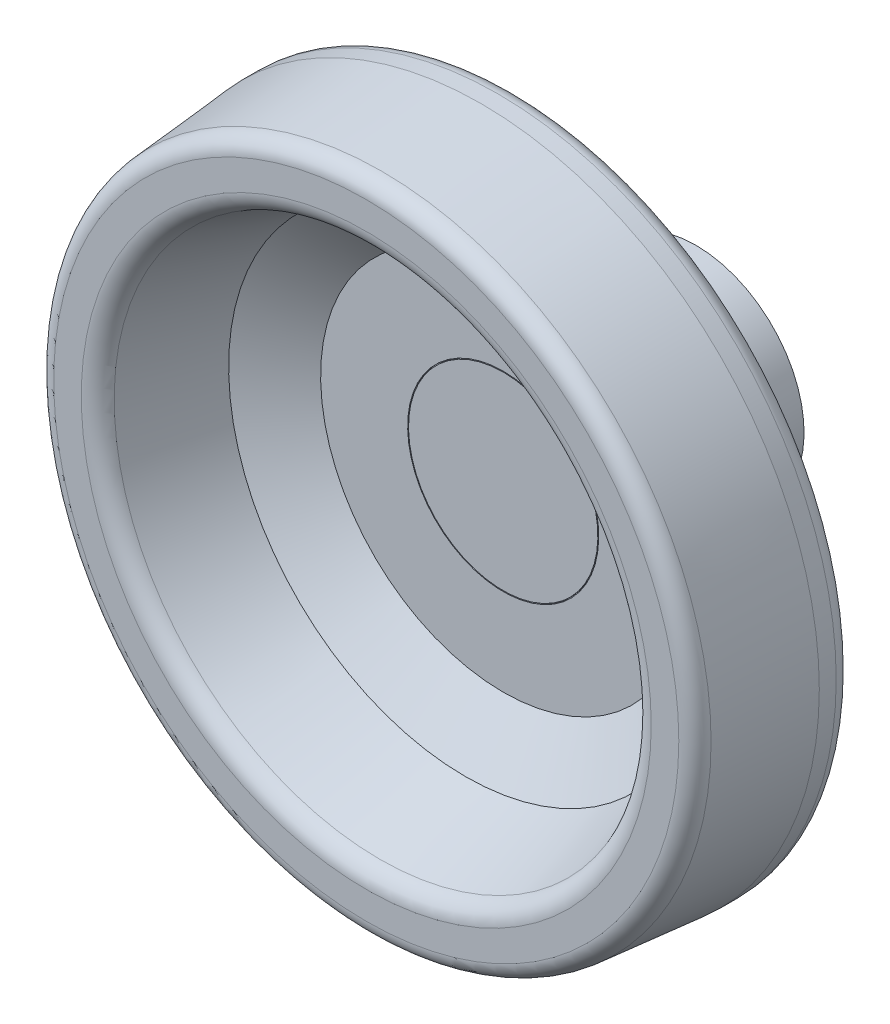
ISO-10303-21;
HEADER;
FILE_DESCRIPTION(('STEP AP214'),'2;1');
FILE_NAME('part.step','',(''),(''),'','','');
FILE_SCHEMA(('AUTOMOTIVE_DESIGN { 1 0 10303 214 1 1 1 1 }'));
ENDSEC;
DATA;
#1=APPLICATION_CONTEXT('core data for automotive mechanical design processes');
#2=APPLICATION_PROTOCOL_DEFINITION('international standard','automotive_design',2000,#1);
#3=PRODUCT_CONTEXT('',#1,'mechanical');
#4=PRODUCT('Part','Part','',(#3));
#5=PRODUCT_RELATED_PRODUCT_CATEGORY('part','',(#4));
#6=PRODUCT_DEFINITION_FORMATION('','',#4);
#7=PRODUCT_DEFINITION_CONTEXT('part definition',#1,'design');
#8=PRODUCT_DEFINITION('design','',#6,#7);
#9=PRODUCT_DEFINITION_SHAPE('','',#8);
#10=(LENGTH_UNIT() NAMED_UNIT(*) SI_UNIT(.MILLI.,.METRE.));
#11=(NAMED_UNIT(*) PLANE_ANGLE_UNIT() SI_UNIT($,.RADIAN.));
#12=(NAMED_UNIT(*) SI_UNIT($,.STERADIAN.) SOLID_ANGLE_UNIT());
#13=UNCERTAINTY_MEASURE_WITH_UNIT(LENGTH_MEASURE(1.E-05),#10,'distance_accuracy_value','');
#14=(GEOMETRIC_REPRESENTATION_CONTEXT(3) GLOBAL_UNCERTAINTY_ASSIGNED_CONTEXT((#13)) GLOBAL_UNIT_ASSIGNED_CONTEXT((#10,
#11,#12)) REPRESENTATION_CONTEXT('',''));
#15=CARTESIAN_POINT('',(0.,0.,0.));
#16=DIRECTION('',(0.,0.,1.));
#17=DIRECTION('',(1.,0.,0.));
#18=AXIS2_PLACEMENT_3D('',#15,#16,#17);
#19=CARTESIAN_POINT('',(6.89,0.,27.));
#20=DIRECTION('',(0.,0.,-1.));
#21=DIRECTION('',(0.,1.,0.));
#22=AXIS2_PLACEMENT_3D('',#19,#20,#21);
#23=PLANE('',#22);
#24=CARTESIAN_POINT('',(0.,0.,27.));
#25=DIRECTION('',(0.,0.,-1.));
#26=DIRECTION('',(0.,1.,0.));
#27=AXIS2_PLACEMENT_3D('',#24,#25,#26);
#28=CIRCLE('',#27,13.78);
#29=CARTESIAN_POINT('',(0.,13.78,27.));
#30=VERTEX_POINT('',#29);
#31=EDGE_CURVE('E391',#30,#30,#28,.T.);
#32=ORIENTED_EDGE('',*,*,#31,.T.);
#33=EDGE_LOOP('',(#32));
#34=FACE_BOUND('',#33,.T.);
#35=ADVANCED_FACE('F14',(#34),#23,.T.);
#36=CARTESIAN_POINT('',(7.,0.,28.75));
#37=DIRECTION('',(0.,0.,1.));
#38=DIRECTION('',(0.,-1.,0.));
#39=AXIS2_PLACEMENT_3D('',#36,#37,#38);
#40=PLANE('',#39);
#41=CARTESIAN_POINT('',(0.,0.,28.75));
#42=DIRECTION('',(0.,0.,-1.));
#43=DIRECTION('',(0.,1.,0.));
#44=AXIS2_PLACEMENT_3D('',#41,#42,#43);
#45=CIRCLE('',#44,14.);
#46=CARTESIAN_POINT('',(0.,14.,28.75));
#47=VERTEX_POINT('',#46);
#48=EDGE_CURVE('E388',#47,#47,#45,.T.);
#49=ORIENTED_EDGE('',*,*,#48,.F.);
#50=EDGE_LOOP('',(#49));
#51=FACE_BOUND('',#50,.T.);
#52=ADVANCED_FACE('F173',(#51),#40,.T.);
#53=CARTESIAN_POINT('',(0.,0.,25.25));
#54=DIRECTION('',(0.,0.,-1.));
#55=DIRECTION('',(0.,1.,0.));
#56=AXIS2_PLACEMENT_3D('',#53,#54,#55);
#57=CYLINDRICAL_SURFACE('',#56,13.78);
#58=CARTESIAN_POINT('',(0.,0.,23.5));
#59=DIRECTION('',(0.,0.,-1.));
#60=DIRECTION('',(0.,1.,0.));
#61=AXIS2_PLACEMENT_3D('',#58,#59,#60);
#62=CIRCLE('',#61,13.78);
#63=CARTESIAN_POINT('',(0.,13.78,23.5));
#64=VERTEX_POINT('',#63);
#65=EDGE_CURVE('E385',#64,#64,#62,.F.);
#66=ORIENTED_EDGE('',*,*,#65,.F.);
#67=EDGE_LOOP('',(#66));
#68=FACE_BOUND('',#67,.T.);
#69=ORIENTED_EDGE('',*,*,#31,.F.);
#70=EDGE_LOOP('',(#69));
#71=FACE_BOUND('',#70,.T.);
#72=ADVANCED_FACE('F169',(#68,#71),#57,.F.);
#73=CARTESIAN_POINT('',(0.,0.,28.623));
#74=DIRECTION('',(0.,0.,-1.));
#75=DIRECTION('',(0.,1.,0.));
#76=AXIS2_PLACEMENT_3D('',#73,#74,#75);
#77=CYLINDRICAL_SURFACE('',#76,14.);
#78=ORIENTED_EDGE('',*,*,#48,.T.);
#79=EDGE_LOOP('',(#78));
#80=FACE_BOUND('',#79,.T.);
#81=CARTESIAN_POINT('',(0.,0.,28.496));
#82=DIRECTION('',(0.,0.,-1.));
#83=DIRECTION('',(0.,1.,0.));
#84=AXIS2_PLACEMENT_3D('',#81,#82,#83);
#85=CIRCLE('',#84,14.);
#86=CARTESIAN_POINT('',(0.,14.,28.496));
#87=VERTEX_POINT('',#86);
#88=EDGE_CURVE('E382',#87,#87,#85,.T.);
#89=ORIENTED_EDGE('',*,*,#88,.F.);
#90=EDGE_LOOP('',(#89));
#91=FACE_BOUND('',#90,.T.);
#92=ADVANCED_FACE('F165',(#80,#91),#77,.T.);
#93=CARTESIAN_POINT('',(13.39,0.,23.5));
#94=DIRECTION('',(0.,0.,1.));
#95=DIRECTION('',(0.,-1.,0.));
#96=AXIS2_PLACEMENT_3D('',#93,#94,#95);
#97=PLANE('',#96);
#98=ORIENTED_EDGE('',*,*,#65,.T.);
#99=EDGE_LOOP('',(#98));
#100=FACE_BOUND('',#99,.T.);
#101=CARTESIAN_POINT('',(0.,0.,23.5));
#102=DIRECTION('',(0.,0.,-1.));
#103=DIRECTION('',(0.,1.,0.));
#104=AXIS2_PLACEMENT_3D('',#101,#102,#103);
#105=CIRCLE('',#104,13.);
#106=CARTESIAN_POINT('',(0.,13.,23.5));
#107=VERTEX_POINT('',#106);
#108=EDGE_CURVE('E379',#107,#107,#105,.T.);
#109=ORIENTED_EDGE('',*,*,#108,.T.);
#110=EDGE_LOOP('',(#109));
#111=FACE_BOUND('',#110,.T.);
#112=ADVANCED_FACE('F161',(#100,#111),#97,.T.);
#113=CARTESIAN_POINT('',(14.0635,0.,28.496));
#114=DIRECTION('',(0.,0.,1.));
#115=DIRECTION('',(0.,-1.,0.));
#116=AXIS2_PLACEMENT_3D('',#113,#114,#115);
#117=PLANE('',#116);
#118=CARTESIAN_POINT('',(0.,0.,28.496));
#119=DIRECTION('',(0.,0.,-1.));
#120=DIRECTION('',(0.,1.,0.));
#121=AXIS2_PLACEMENT_3D('',#118,#119,#120);
#122=CIRCLE('',#121,14.127);
#123=CARTESIAN_POINT('',(0.,14.127,28.496));
#124=VERTEX_POINT('',#123);
#125=EDGE_CURVE('E376',#124,#124,#122,.F.);
#126=ORIENTED_EDGE('',*,*,#125,.T.);
#127=EDGE_LOOP('',(#126));
#128=FACE_BOUND('',#127,.T.);
#129=ORIENTED_EDGE('',*,*,#88,.T.);
#130=EDGE_LOOP('',(#129));
#131=FACE_BOUND('',#130,.T.);
#132=ADVANCED_FACE('F157',(#128,#131),#117,.T.);
#133=CARTESIAN_POINT('',(0.,0.,22.75));
#134=DIRECTION('',(0.,0.,-1.));
#135=DIRECTION('',(0.,1.,0.));
#136=AXIS2_PLACEMENT_3D('',#133,#134,#135);
#137=CYLINDRICAL_SURFACE('',#136,13.);
#138=CARTESIAN_POINT('',(0.,0.,22.));
#139=DIRECTION('',(0.,0.,-1.));
#140=DIRECTION('',(0.,1.,0.));
#141=AXIS2_PLACEMENT_3D('',#138,#139,#140);
#142=CIRCLE('',#141,13.);
#143=CARTESIAN_POINT('',(0.,13.,22.));
#144=VERTEX_POINT('',#143);
#145=EDGE_CURVE('E373',#144,#144,#142,.F.);
#146=ORIENTED_EDGE('',*,*,#145,.F.);
#147=EDGE_LOOP('',(#146));
#148=FACE_BOUND('',#147,.T.);
#149=ORIENTED_EDGE('',*,*,#108,.F.);
#150=EDGE_LOOP('',(#149));
#151=FACE_BOUND('',#150,.T.);
#152=ADVANCED_FACE('F153',(#148,#151),#137,.F.);
#153=CARTESIAN_POINT('',(0.,0.,28.623));
#154=DIRECTION('',(0.,0.,-1.));
#155=DIRECTION('',(0.,1.,0.));
#156=AXIS2_PLACEMENT_3D('',#153,#154,#155);
#157=CYLINDRICAL_SURFACE('',#156,14.127);
#158=ORIENTED_EDGE('',*,*,#125,.F.);
#159=EDGE_LOOP('',(#158));
#160=FACE_BOUND('',#159,.T.);
#161=CARTESIAN_POINT('',(0.,0.,28.75));
#162=DIRECTION('',(0.,0.,-1.));
#163=DIRECTION('',(0.,1.,0.));
#164=AXIS2_PLACEMENT_3D('',#161,#162,#163);
#165=CIRCLE('',#164,14.127);
#166=CARTESIAN_POINT('',(0.,14.127,28.75));
#167=VERTEX_POINT('',#166);
#168=EDGE_CURVE('E370',#167,#167,#165,.T.);
#169=ORIENTED_EDGE('',*,*,#168,.F.);
#170=EDGE_LOOP('',(#169));
#171=FACE_BOUND('',#170,.T.);
#172=ADVANCED_FACE('F149',(#160,#171),#157,.F.);
#173=CARTESIAN_POINT('',(9.,0.,22.));
#174=DIRECTION('',(0.,0.,1.));
#175=DIRECTION('',(-1.,0.,0.));
#176=AXIS2_PLACEMENT_3D('',#173,#174,#175);
#177=PLANE('',#176);
#178=ORIENTED_EDGE('',*,*,#145,.T.);
#179=EDGE_LOOP('',(#178));
#180=FACE_BOUND('',#179,.T.);
#181=CARTESIAN_POINT('',(0.,0.,22.));
#182=DIRECTION('',(0.,0.,-1.));
#183=DIRECTION('',(0.,1.,0.));
#184=AXIS2_PLACEMENT_3D('',#181,#182,#183);
#185=CIRCLE('',#184,5.);
#186=CARTESIAN_POINT('',(0.,5.,22.));
#187=VERTEX_POINT('',#186);
#188=EDGE_CURVE('E367',#187,#187,#185,.T.);
#189=ORIENTED_EDGE('',*,*,#188,.T.);
#190=EDGE_LOOP('',(#189));
#191=FACE_BOUND('',#190,.T.);
#192=ADVANCED_FACE('F145',(#180,#191),#177,.T.);
#193=CARTESIAN_POINT('',(20.5635,0.,28.75));
#194=DIRECTION('',(0.,0.,1.));
#195=DIRECTION('',(0.,-1.,0.));
#196=AXIS2_PLACEMENT_3D('',#193,#194,#195);
#197=PLANE('',#196);
#198=CARTESIAN_POINT('',(0.,0.,28.75));
#199=DIRECTION('',(0.,0.,1.));
#200=DIRECTION('',(0.,-1.,0.));
#201=AXIS2_PLACEMENT_3D('',#198,#199,#200);
#202=CIRCLE('',#201,27.);
#203=CARTESIAN_POINT('',(0.,-27.,28.75));
#204=VERTEX_POINT('',#203);
#205=EDGE_CURVE('E364',#204,#204,#202,.T.);
#206=ORIENTED_EDGE('',*,*,#205,.T.);
#207=EDGE_LOOP('',(#206));
#208=FACE_BOUND('',#207,.T.);
#209=ORIENTED_EDGE('',*,*,#168,.T.);
#210=EDGE_LOOP('',(#209));
#211=FACE_BOUND('',#210,.T.);
#212=ADVANCED_FACE('F141',(#208,#211),#197,.T.);
#213=CARTESIAN_POINT('',(0.,0.,11.));
#214=DIRECTION('',(0.,0.,-1.));
#215=DIRECTION('',(0.,1.,0.));
#216=AXIS2_PLACEMENT_3D('',#213,#214,#215);
#217=CYLINDRICAL_SURFACE('',#216,5.);
#218=CARTESIAN_POINT('',(0.,0.,0.));
#219=DIRECTION('',(0.,0.,-1.));
#220=DIRECTION('',(0.,1.,0.));
#221=AXIS2_PLACEMENT_3D('',#218,#219,#220);
#222=CIRCLE('',#221,5.);
#223=CARTESIAN_POINT('',(0.,5.,0.));
#224=VERTEX_POINT('',#223);
#225=EDGE_CURVE('E361',#224,#224,#222,.F.);
#226=ORIENTED_EDGE('',*,*,#225,.F.);
#227=EDGE_LOOP('',(#226));
#228=FACE_BOUND('',#227,.T.);
#229=ORIENTED_EDGE('',*,*,#188,.F.);
#230=EDGE_LOOP('',(#229));
#231=FACE_BOUND('',#230,.T.);
#232=ADVANCED_FACE('F137',(#228,#231),#217,.F.);
#233=CARTESIAN_POINT('',(0.,0.,34.3516603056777));
#234=DIRECTION('',(0.,0.,1.));
#235=DIRECTION('',(0.,-1.,0.));
#236=AXIS2_PLACEMENT_3D('',#233,#234,#235);
#237=CONICAL_SURFACE('',#236,35.,0.959931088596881);
#238=ORIENTED_EDGE('',*,*,#205,.F.);
#239=EDGE_LOOP('',(#238));
#240=FACE_BOUND('',#239,.T.);
#241=CARTESIAN_POINT('',(0.,0.,34.3516603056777));
#242=DIRECTION('',(0.,0.,1.));
#243=DIRECTION('',(1.,0.,0.));
#244=AXIS2_PLACEMENT_3D('',#241,#242,#243);
#245=CIRCLE('',#244,35.);
#246=CARTESIAN_POINT('',(35.,0.,34.3516603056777));
#247=VERTEX_POINT('',#246);
#248=EDGE_CURVE('E355',#247,#247,#245,.T.);
#249=ORIENTED_EDGE('',*,*,#248,.T.);
#250=EDGE_LOOP('',(#249));
#251=FACE_BOUND('',#250,.T.);
#252=ADVANCED_FACE('F133',(#240,#251),#237,.F.);
#253=CARTESIAN_POINT('',(8.,0.,0.));
#254=DIRECTION('',(0.,0.,-1.));
#255=DIRECTION('',(0.,1.,0.));
#256=AXIS2_PLACEMENT_3D('',#253,#254,#255);
#257=PLANE('',#256);
#258=ORIENTED_EDGE('',*,*,#225,.T.);
#259=EDGE_LOOP('',(#258));
#260=FACE_BOUND('',#259,.T.);
#261=CARTESIAN_POINT('',(0.,0.,0.));
#262=DIRECTION('',(0.,0.,-1.));
#263=DIRECTION('',(0.,1.,0.));
#264=AXIS2_PLACEMENT_3D('',#261,#262,#263);
#265=CIRCLE('',#264,11.);
#266=CARTESIAN_POINT('',(0.,11.,0.));
#267=VERTEX_POINT('',#266);
#268=EDGE_CURVE('E358',#267,#267,#265,.F.);
#269=ORIENTED_EDGE('',*,*,#268,.F.);
#270=EDGE_LOOP('',(#269));
#271=FACE_BOUND('',#270,.T.);
#272=ADVANCED_FACE('F129',(#260,#271),#257,.T.);
#273=CARTESIAN_POINT('',(0.,0.,49.));
#274=DIRECTION('',(0.,0.,1.));
#275=DIRECTION('',(0.,-1.,0.));
#276=AXIS2_PLACEMENT_3D('',#273,#274,#275);
#277=CONICAL_SURFACE('',#276,40.,0.328935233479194);
#278=CARTESIAN_POINT('',(0.,0.,46.9691065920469));
#279=DIRECTION('',(0.,0.,1.));
#280=DIRECTION('',(0.,-1.,0.));
#281=AXIS2_PLACEMENT_3D('',#278,#279,#280);
#282=CIRCLE('',#281,39.3067837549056);
#283=CARTESIAN_POINT('',(0.,-39.3067837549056,46.9691065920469));
#284=VERTEX_POINT('',#283);
#285=EDGE_CURVE('E9',#284,#284,#282,.T.);
#286=ORIENTED_EDGE('',*,*,#285,.T.);
#287=EDGE_LOOP('',(#286));
#288=FACE_BOUND('',#287,.T.);
#289=ORIENTED_EDGE('',*,*,#248,.F.);
#290=EDGE_LOOP('',(#289));
#291=FACE_BOUND('',#290,.T.);
#292=ADVANCED_FACE('F125',(#288,#291),#277,.F.);
#293=CARTESIAN_POINT('',(0.,0.,0.127));
#294=DIRECTION('',(0.,0.,-1.));
#295=DIRECTION('',(0.,1.,0.));
#296=AXIS2_PLACEMENT_3D('',#293,#294,#295);
#297=CYLINDRICAL_SURFACE('',#296,11.);
#298=CARTESIAN_POINT('',(0.,0.,0.254));
#299=DIRECTION('',(0.,0.,-1.));
#300=DIRECTION('',(0.,1.,0.));
#301=AXIS2_PLACEMENT_3D('',#298,#299,#300);
#302=CIRCLE('',#301,11.);
#303=CARTESIAN_POINT('',(0.,11.,0.254));
#304=VERTEX_POINT('',#303);
#305=EDGE_CURVE('E63',#304,#304,#302,.F.);
#306=ORIENTED_EDGE('',*,*,#305,.F.);
#307=EDGE_LOOP('',(#306));
#308=FACE_BOUND('',#307,.T.);
#309=ORIENTED_EDGE('',*,*,#268,.T.);
#310=EDGE_LOOP('',(#309));
#311=FACE_BOUND('',#310,.T.);
#312=ADVANCED_FACE('F112',(#308,#311),#297,.T.);
#313=CARTESIAN_POINT('',(43.1109323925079,0.,49.));
#314=DIRECTION('',(0.,0.,1.));
#315=DIRECTION('',(0.,-1.,0.));
#316=AXIS2_PLACEMENT_3D('',#313,#314,#315);
#317=PLANE('',#316);
#318=CARTESIAN_POINT('',(0.,0.,49.));
#319=DIRECTION('',(0.,0.,1.));
#320=DIRECTION('',(1.,0.,0.));
#321=AXIS2_PLACEMENT_3D('',#318,#319,#320);
#322=CIRCLE('',#321,42.1459442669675);
#323=CARTESIAN_POINT('',(42.1459442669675,0.,49.));
#324=VERTEX_POINT('',#323);
#325=EDGE_CURVE('E23',#324,#324,#322,.F.);
#326=ORIENTED_EDGE('',*,*,#325,.T.);
#327=EDGE_LOOP('',(#326));
#328=FACE_BOUND('',#327,.T.);
#329=CARTESIAN_POINT('',(0.,0.,49.));
#330=DIRECTION('',(0.,0.,-1.));
#331=DIRECTION('',(0.,-1.,0.));
#332=AXIS2_PLACEMENT_3D('',#329,#330,#331);
#333=CIRCLE('',#332,46.2218647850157);
#334=CARTESIAN_POINT('',(0.,-46.2218647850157,49.));
#335=VERTEX_POINT('',#334);
#336=CARTESIAN_POINT('',(0.,46.2218647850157,49.));
#337=VERTEX_POINT('',#336);
#338=EDGE_CURVE('E53',#335,#337,#333,.T.);
#339=ORIENTED_EDGE('',*,*,#338,.F.);
#340=CARTESIAN_POINT('',(0.,0.,49.));
#341=DIRECTION('',(0.,0.,-1.));
#342=DIRECTION('',(1.,0.,0.));
#343=AXIS2_PLACEMENT_3D('',#340,#341,#342);
#344=CIRCLE('',#343,46.2218647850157);
#345=CARTESIAN_POINT('',(46.2218647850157,0.,49.));
#346=VERTEX_POINT('',#345);
#347=EDGE_CURVE('E59',#346,#335,#344,.T.);
#348=ORIENTED_EDGE('',*,*,#347,.F.);
#349=CARTESIAN_POINT('',(0.,0.,49.));
#350=DIRECTION('',(0.,0.,-1.));
#351=DIRECTION('',(0.,1.,0.));
#352=AXIS2_PLACEMENT_3D('',#349,#350,#351);
#353=CIRCLE('',#352,46.2218647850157);
#354=EDGE_CURVE('E61',#337,#346,#353,.T.);
#355=ORIENTED_EDGE('',*,*,#354,.F.);
#356=EDGE_LOOP('',(#339,#348,#355));
#357=FACE_BOUND('',#356,.T.);
#358=ADVANCED_FACE('F58',(#328,#357),#317,.T.);
#359=CARTESIAN_POINT('',(13.5,0.,0.254));
#360=DIRECTION('',(0.,0.,-1.));
#361=DIRECTION('',(1.,0.,0.));
#362=AXIS2_PLACEMENT_3D('',#359,#360,#361);
#363=PLANE('',#362);
#364=ORIENTED_EDGE('',*,*,#305,.T.);
#365=EDGE_LOOP('',(#364));
#366=FACE_BOUND('',#365,.T.);
#367=CARTESIAN_POINT('',(0.,0.,0.254));
#368=DIRECTION('',(0.,0.,-1.));
#369=DIRECTION('',(0.,1.,0.));
#370=AXIS2_PLACEMENT_3D('',#367,#368,#369);
#371=CIRCLE('',#370,16.);
#372=CARTESIAN_POINT('',(0.,16.,0.254));
#373=VERTEX_POINT('',#372);
#374=EDGE_CURVE('E69',#373,#373,#371,.F.);
#375=ORIENTED_EDGE('',*,*,#374,.F.);
#376=EDGE_LOOP('',(#375));
#377=FACE_BOUND('',#376,.T.);
#378=ADVANCED_FACE('F90',(#366,#377),#363,.T.);
#379=CARTESIAN_POINT('',(0.,0.,46.5));
#380=DIRECTION('',(0.,0.,1.));
#381=DIRECTION('',(0.,-1.,0.));
#382=AXIS2_PLACEMENT_3D('',#379,#380,#381);
#383=TOROIDAL_SURFACE('',#382,46.2218647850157,2.5);
#384=CARTESIAN_POINT('',(0.,0.,46.7178893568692));
#385=DIRECTION('',(0.,0.,-1.));
#386=DIRECTION('',(1.,0.,0.));
#387=AXIS2_PLACEMENT_3D('',#384,#385,#386);
#388=CIRCLE('',#387,48.712351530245);
#389=CARTESIAN_POINT('',(48.712351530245,0.,46.7178893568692));
#390=VERTEX_POINT('',#389);
#391=EDGE_CURVE('E100',#390,#390,#388,.T.);
#392=ORIENTED_EDGE('',*,*,#391,.F.);
#393=EDGE_LOOP('',(#392));
#394=FACE_BOUND('',#393,.T.);
#395=ORIENTED_EDGE('',*,*,#354,.T.);
#396=ORIENTED_EDGE('',*,*,#347,.T.);
#397=ORIENTED_EDGE('',*,*,#338,.T.);
#398=EDGE_LOOP('',(#395,#396,#397));
#399=FACE_BOUND('',#398,.T.);
#400=ADVANCED_FACE('F67',(#394,#399),#383,.T.);
#401=CARTESIAN_POINT('',(0.,0.,8.65898757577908));
#402=DIRECTION('',(0.,0.,-1.));
#403=DIRECTION('',(0.,1.,0.));
#404=AXIS2_PLACEMENT_3D('',#401,#402,#403);
#405=CYLINDRICAL_SURFACE('',#404,16.);
#406=CARTESIAN_POINT('',(0.,0.,17.0639751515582));
#407=DIRECTION('',(0.,0.,1.));
#408=DIRECTION('',(0.,-1.,0.));
#409=AXIS2_PLACEMENT_3D('',#406,#407,#408);
#410=CIRCLE('',#409,16.);
#411=CARTESIAN_POINT('',(0.,-16.,17.0639751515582));
#412=VERTEX_POINT('',#411);
#413=EDGE_CURVE('E98',#412,#412,#410,.F.);
#414=ORIENTED_EDGE('',*,*,#413,.T.);
#415=EDGE_LOOP('',(#414));
#416=FACE_BOUND('',#415,.T.);
#417=ORIENTED_EDGE('',*,*,#374,.T.);
#418=EDGE_LOOP('',(#417));
#419=FACE_BOUND('',#418,.T.);
#420=ADVANCED_FACE('F89',(#416,#419),#405,.T.);
#421=CARTESIAN_POINT('',(0.,0.,32.));
#422=DIRECTION('',(0.,0.,-1.));
#423=DIRECTION('',(0.,1.,0.));
#424=AXIS2_PLACEMENT_3D('',#421,#422,#423);
#425=CONICAL_SURFACE('',#424,50.,0.0872664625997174);
#426=CARTESIAN_POINT('',(0.,0.,32.));
#427=DIRECTION('',(0.,0.,-1.));
#428=DIRECTION('',(0.,1.,0.));
#429=AXIS2_PLACEMENT_3D('',#426,#427,#428);
#430=CIRCLE('',#429,50.);
#431=CARTESIAN_POINT('',(0.,50.,32.));
#432=VERTEX_POINT('',#431);
#433=EDGE_CURVE('E341',#432,#432,#430,.T.);
#434=ORIENTED_EDGE('',*,*,#433,.F.);
#435=EDGE_LOOP('',(#434));
#436=FACE_BOUND('',#435,.T.);
#437=ORIENTED_EDGE('',*,*,#391,.T.);
#438=EDGE_LOOP('',(#437));
#439=FACE_BOUND('',#438,.T.);
#440=ADVANCED_FACE('F329',(#436,#439),#425,.T.);
#441=CARTESIAN_POINT('',(0.,0.,17.0639751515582));
#442=DIRECTION('',(0.,0.,1.));
#443=DIRECTION('',(0.,-1.,0.));
#444=AXIS2_PLACEMENT_3D('',#441,#442,#443);
#445=TOROIDAL_SURFACE('',#444,18.5,2.5);
#446=CARTESIAN_POINT('',(0.,0.,19.3549216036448));
#447=DIRECTION('',(0.,0.,1.));
#448=DIRECTION('',(1.,0.,0.));
#449=AXIS2_PLACEMENT_3D('',#446,#447,#448);
#450=CIRCLE('',#449,17.4992181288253);
#451=CARTESIAN_POINT('',(17.4992181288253,0.,19.3549216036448));
#452=VERTEX_POINT('',#451);
#453=EDGE_CURVE('E320',#452,#452,#450,.T.);
#454=ORIENTED_EDGE('',*,*,#453,.F.);
#455=EDGE_LOOP('',(#454));
#456=FACE_BOUND('',#455,.T.);
#457=ORIENTED_EDGE('',*,*,#413,.F.);
#458=EDGE_LOOP('',(#457));
#459=FACE_BOUND('',#458,.T.);
#460=ADVANCED_FACE('F326',(#456,#459),#445,.F.);
#461=CARTESIAN_POINT('',(0.,0.,30.75));
#462=DIRECTION('',(0.,0.,-1.));
#463=DIRECTION('',(0.,1.,0.));
#464=AXIS2_PLACEMENT_3D('',#461,#462,#463);
#465=CYLINDRICAL_SURFACE('',#464,50.);
#466=CARTESIAN_POINT('',(0.,0.,29.5));
#467=DIRECTION('',(0.,0.,1.));
#468=DIRECTION('',(0.,-1.,0.));
#469=AXIS2_PLACEMENT_3D('',#466,#467,#468);
#470=CIRCLE('',#469,50.);
#471=CARTESIAN_POINT('',(0.,-50.,29.5));
#472=VERTEX_POINT('',#471);
#473=EDGE_CURVE('E316',#472,#472,#470,.F.);
#474=ORIENTED_EDGE('',*,*,#473,.F.);
#475=EDGE_LOOP('',(#474));
#476=FACE_BOUND('',#475,.T.);
#477=ORIENTED_EDGE('',*,*,#433,.T.);
#478=EDGE_LOOP('',(#477));
#479=FACE_BOUND('',#478,.T.);
#480=ADVANCED_FACE('F328',(#476,#479),#465,.T.);
#481=CARTESIAN_POINT('',(0.,0.,26.7909464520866));
#482=DIRECTION('',(0.,0.,1.));
#483=DIRECTION('',(0.,-1.,0.));
#484=AXIS2_PLACEMENT_3D('',#481,#482,#483);
#485=CONICAL_SURFACE('',#484,34.5214436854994,1.15893821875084);
#486=CARTESIAN_POINT('',(0.,0.,26.7909464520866));
#487=DIRECTION('',(0.,0.,1.));
#488=DIRECTION('',(0.,-1.,0.));
#489=AXIS2_PLACEMENT_3D('',#486,#487,#488);
#490=CIRCLE('',#489,34.5214436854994);
#491=CARTESIAN_POINT('',(0.,-34.5214436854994,26.7909464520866));
#492=VERTEX_POINT('',#491);
#493=EDGE_CURVE('E314',#492,#492,#490,.F.);
#494=ORIENTED_EDGE('',*,*,#493,.T.);
#495=EDGE_LOOP('',(#494));
#496=FACE_BOUND('',#495,.T.);
#497=ORIENTED_EDGE('',*,*,#453,.T.);
#498=EDGE_LOOP('',(#497));
#499=FACE_BOUND('',#498,.T.);
#500=ADVANCED_FACE('F268',(#496,#499),#485,.T.);
#501=CARTESIAN_POINT('',(0.,0.,29.5));
#502=DIRECTION('',(0.,0.,1.));
#503=DIRECTION('',(0.,-1.,0.));
#504=AXIS2_PLACEMENT_3D('',#501,#502,#503);
#505=TOROIDAL_SURFACE('',#504,47.5,2.5);
#506=ORIENTED_EDGE('',*,*,#473,.T.);
#507=EDGE_LOOP('',(#506));
#508=FACE_BOUND('',#507,.T.);
#509=CARTESIAN_POINT('',(0.,0.,27.));
#510=DIRECTION('',(0.,0.,1.));
#511=DIRECTION('',(0.,1.,0.));
#512=AXIS2_PLACEMENT_3D('',#509,#510,#511);
#513=CIRCLE('',#512,47.5);
#514=CARTESIAN_POINT('',(0.,-47.5,27.));
#515=VERTEX_POINT('',#514);
#516=CARTESIAN_POINT('',(0.,47.5,27.));
#517=VERTEX_POINT('',#516);
#518=EDGE_CURVE('E311',#515,#517,#513,.F.);
#519=ORIENTED_EDGE('',*,*,#518,.F.);
#520=CARTESIAN_POINT('',(0.,0.,27.));
#521=DIRECTION('',(0.,0.,1.));
#522=DIRECTION('',(0.,-1.,0.));
#523=AXIS2_PLACEMENT_3D('',#520,#521,#522);
#524=CIRCLE('',#523,47.5);
#525=CARTESIAN_POINT('',(47.5,0.,27.));
#526=VERTEX_POINT('',#525);
#527=EDGE_CURVE('E312',#526,#515,#524,.F.);
#528=ORIENTED_EDGE('',*,*,#527,.F.);
#529=CARTESIAN_POINT('',(0.,0.,27.));
#530=DIRECTION('',(0.,0.,1.));
#531=DIRECTION('',(1.,0.,0.));
#532=AXIS2_PLACEMENT_3D('',#529,#530,#531);
#533=CIRCLE('',#532,47.5);
#534=EDGE_CURVE('E291',#517,#526,#533,.F.);
#535=ORIENTED_EDGE('',*,*,#534,.F.);
#536=EDGE_LOOP('',(#519,#528,#535));
#537=FACE_BOUND('',#536,.T.);
#538=ADVANCED_FACE('F195',(#508,#537),#505,.T.);
#539=CARTESIAN_POINT('',(0.,0.,24.5));
#540=DIRECTION('',(0.,0.,1.));
#541=DIRECTION('',(0.,-1.,0.));
#542=AXIS2_PLACEMENT_3D('',#539,#540,#541);
#543=TOROIDAL_SURFACE('',#542,35.5222255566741,2.49999999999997);
#544=CARTESIAN_POINT('',(0.,0.,27.));
#545=DIRECTION('',(0.,0.,-1.));
#546=DIRECTION('',(1.,0.,0.));
#547=AXIS2_PLACEMENT_3D('',#544,#545,#546);
#548=CIRCLE('',#547,35.5222255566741);
#549=CARTESIAN_POINT('',(0.,-35.5222255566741,27.));
#550=VERTEX_POINT('',#549);
#551=CARTESIAN_POINT('',(35.5222255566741,0.,27.));
#552=VERTEX_POINT('',#551);
#553=EDGE_CURVE('E31',#550,#552,#548,.F.);
#554=ORIENTED_EDGE('',*,*,#553,.F.);
#555=CARTESIAN_POINT('',(0.,0.,27.));
#556=DIRECTION('',(0.,0.,-1.));
#557=DIRECTION('',(0.,-1.,0.));
#558=AXIS2_PLACEMENT_3D('',#555,#556,#557);
#559=CIRCLE('',#558,35.5222255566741);
#560=CARTESIAN_POINT('',(0.,35.5222255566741,27.));
#561=VERTEX_POINT('',#560);
#562=EDGE_CURVE('E310',#561,#550,#559,.F.);
#563=ORIENTED_EDGE('',*,*,#562,.F.);
#564=CARTESIAN_POINT('',(0.,0.,27.));
#565=DIRECTION('',(0.,0.,-1.));
#566=DIRECTION('',(0.,1.,0.));
#567=AXIS2_PLACEMENT_3D('',#564,#565,#566);
#568=CIRCLE('',#567,35.5222255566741);
#569=EDGE_CURVE('E253',#552,#561,#568,.F.);
#570=ORIENTED_EDGE('',*,*,#569,.F.);
#571=EDGE_LOOP('',(#554,#563,#570));
#572=FACE_BOUND('',#571,.T.);
#573=ORIENTED_EDGE('',*,*,#493,.F.);
#574=EDGE_LOOP('',(#573));
#575=FACE_BOUND('',#574,.T.);
#576=ADVANCED_FACE('F188',(#572,#575),#543,.F.);
#577=CARTESIAN_POINT('',(41.511112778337,0.,27.));
#578=DIRECTION('',(0.,0.,-1.));
#579=DIRECTION('',(1.,0.,0.));
#580=AXIS2_PLACEMENT_3D('',#577,#578,#579);
#581=PLANE('',#580);
#582=ORIENTED_EDGE('',*,*,#562,.T.);
#583=ORIENTED_EDGE('',*,*,#553,.T.);
#584=ORIENTED_EDGE('',*,*,#569,.T.);
#585=EDGE_LOOP('',(#582,#583,#584));
#586=FACE_BOUND('',#585,.T.);
#587=ORIENTED_EDGE('',*,*,#527,.T.);
#588=ORIENTED_EDGE('',*,*,#518,.T.);
#589=ORIENTED_EDGE('',*,*,#534,.T.);
#590=EDGE_LOOP('',(#587,#588,#589));
#591=FACE_BOUND('',#590,.T.);
#592=ADVANCED_FACE('F185',(#586,#591),#581,.T.);
#593=CARTESIAN_POINT('',(0.,0.,46.));
#594=DIRECTION('',(0.,0.,1.));
#595=DIRECTION('',(1.,0.,0.));
#596=AXIS2_PLACEMENT_3D('',#593,#594,#595);
#597=TOROIDAL_SURFACE('',#596,42.1459442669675,3.);
#598=ORIENTED_EDGE('',*,*,#285,.F.);
#599=EDGE_LOOP('',(#598));
#600=FACE_BOUND('',#599,.T.);
#601=ORIENTED_EDGE('',*,*,#325,.F.);
#602=EDGE_LOOP('',(#601));
#603=FACE_BOUND('',#602,.T.);
#604=ADVANCED_FACE('F16',(#600,#603),#597,.T.);
#605=CLOSED_SHELL('',(#35,#52,#72,#92,#112,#132,#152,#172,#192,#212,#232,#252,#272,#292,#312,
#358,#378,#400,#420,#440,#460,#480,#500,#538,#576,#592,#604));
#606=MANIFOLD_SOLID_BREP('B1',#605);
#607=ADVANCED_BREP_SHAPE_REPRESENTATION('',(#18,#606),#14);
#608=SHAPE_DEFINITION_REPRESENTATION(#9,#607);
ENDSEC;
END-ISO-10303-21;
